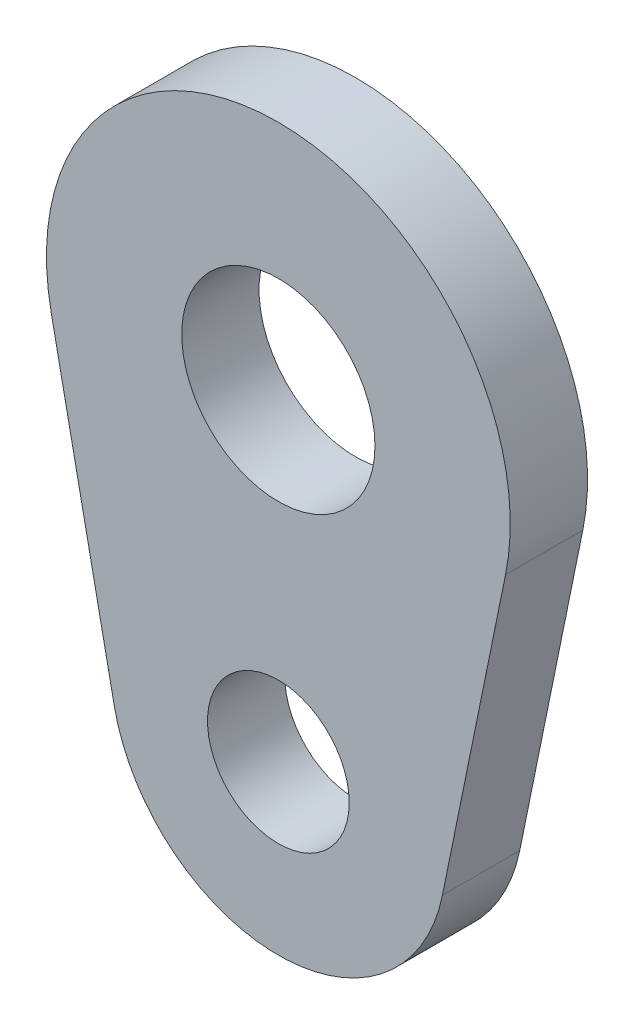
ISO-10303-21;
HEADER;
FILE_DESCRIPTION(('STEP AP214'),'2;1');
FILE_NAME('part.step','',(''),(''),'','','');
FILE_SCHEMA(('AUTOMOTIVE_DESIGN { 1 0 10303 214 1 1 1 1 }'));
ENDSEC;
DATA;
#1=APPLICATION_CONTEXT('core data for automotive mechanical design processes');
#2=APPLICATION_PROTOCOL_DEFINITION('international standard','automotive_design',2000,#1);
#3=PRODUCT_CONTEXT('',#1,'mechanical');
#4=PRODUCT('Part','Part','',(#3));
#5=PRODUCT_RELATED_PRODUCT_CATEGORY('part','',(#4));
#6=PRODUCT_DEFINITION_FORMATION('','',#4);
#7=PRODUCT_DEFINITION_CONTEXT('part definition',#1,'design');
#8=PRODUCT_DEFINITION('design','',#6,#7);
#9=PRODUCT_DEFINITION_SHAPE('','',#8);
#10=(LENGTH_UNIT() NAMED_UNIT(*) SI_UNIT(.MILLI.,.METRE.));
#11=(NAMED_UNIT(*) PLANE_ANGLE_UNIT() SI_UNIT($,.RADIAN.));
#12=(NAMED_UNIT(*) SI_UNIT($,.STERADIAN.) SOLID_ANGLE_UNIT());
#13=UNCERTAINTY_MEASURE_WITH_UNIT(LENGTH_MEASURE(1.E-05),#10,'distance_accuracy_value','');
#14=(GEOMETRIC_REPRESENTATION_CONTEXT(3) GLOBAL_UNCERTAINTY_ASSIGNED_CONTEXT((#13)) GLOBAL_UNIT_ASSIGNED_CONTEXT((#10,
#11,#12)) REPRESENTATION_CONTEXT('',''));
#15=CARTESIAN_POINT('',(0.,0.,0.));
#16=DIRECTION('',(0.,0.,1.));
#17=DIRECTION('',(1.,0.,0.));
#18=AXIS2_PLACEMENT_3D('',#15,#16,#17);
#19=CARTESIAN_POINT('',(0.,0.,6.));
#20=DIRECTION('',(0.,0.,1.));
#21=DIRECTION('',(1.,0.,0.));
#22=AXIS2_PLACEMENT_3D('',#19,#20,#21);
#23=PLANE('',#22);
#24=CARTESIAN_POINT('',(0.,0.,6.));
#25=DIRECTION('',(0.,0.,1.));
#26=DIRECTION('',(1.,0.,0.));
#27=AXIS2_PLACEMENT_3D('',#24,#25,#26);
#28=CIRCLE('',#27,7.5);
#29=CARTESIAN_POINT('',(7.5,0.,6.));
#30=VERTEX_POINT('',#29);
#31=EDGE_CURVE('E90',#30,#30,#28,.T.);
#32=ORIENTED_EDGE('',*,*,#31,.F.);
#33=EDGE_LOOP('',(#32));
#34=FACE_BOUND('',#33,.T.);
#35=CARTESIAN_POINT('',(0.,0.,6.));
#36=DIRECTION('',(0.,0.,1.));
#37=DIRECTION('',(1.,0.,0.));
#38=AXIS2_PLACEMENT_3D('',#35,#36,#37);
#39=CIRCLE('',#38,18.);
#40=CARTESIAN_POINT('',(17.6363261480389,-3.6,6.));
#41=VERTEX_POINT('',#40);
#42=CARTESIAN_POINT('',(-17.6363261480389,-3.6,6.));
#43=VERTEX_POINT('',#42);
#44=EDGE_CURVE('E100',#41,#43,#39,.T.);
#45=ORIENTED_EDGE('',*,*,#44,.T.);
#46=DIRECTION('',(0.2,-0.979795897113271,0.));
#47=VECTOR('',#46,1.);
#48=CARTESIAN_POINT('',(-17.6363261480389,-3.6,6.));
#49=LINE('',#48,#47);
#50=CARTESIAN_POINT('',(-12.7373466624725,-27.6,6.));
#51=VERTEX_POINT('',#50);
#52=EDGE_CURVE('E85',#43,#51,#49,.T.);
#53=ORIENTED_EDGE('',*,*,#52,.T.);
#54=CARTESIAN_POINT('',(0.,-25.,6.));
#55=DIRECTION('',(0.,0.,1.));
#56=DIRECTION('',(-1.,0.,0.));
#57=AXIS2_PLACEMENT_3D('',#54,#55,#56);
#58=CIRCLE('',#57,13.);
#59=CARTESIAN_POINT('',(12.7373466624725,-27.6,6.));
#60=VERTEX_POINT('',#59);
#61=EDGE_CURVE('E51',#51,#60,#58,.T.);
#62=ORIENTED_EDGE('',*,*,#61,.T.);
#63=DIRECTION('',(0.2,0.979795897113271,0.));
#64=VECTOR('',#63,1.);
#65=CARTESIAN_POINT('',(17.6363261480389,-3.6,6.));
#66=LINE('',#65,#64);
#67=EDGE_CURVE('E46',#60,#41,#66,.T.);
#68=ORIENTED_EDGE('',*,*,#67,.T.);
#69=EDGE_LOOP('',(#45,#53,#62,#68));
#70=FACE_BOUND('',#69,.T.);
#71=CARTESIAN_POINT('',(0.,-25.,6.));
#72=DIRECTION('',(0.,0.,1.));
#73=DIRECTION('',(1.,0.,0.));
#74=AXIS2_PLACEMENT_3D('',#71,#72,#73);
#75=CIRCLE('',#74,5.5);
#76=CARTESIAN_POINT('',(5.5,-25.,6.));
#77=VERTEX_POINT('',#76);
#78=EDGE_CURVE('E118',#77,#77,#75,.T.);
#79=ORIENTED_EDGE('',*,*,#78,.F.);
#80=EDGE_LOOP('',(#79));
#81=FACE_BOUND('',#80,.T.);
#82=ADVANCED_FACE('F31',(#34,#70,#81),#23,.T.);
#83=CARTESIAN_POINT('',(0.,0.,0.));
#84=DIRECTION('',(0.,0.,1.));
#85=DIRECTION('',(1.,0.,0.));
#86=AXIS2_PLACEMENT_3D('',#83,#84,#85);
#87=PLANE('',#86);
#88=CARTESIAN_POINT('',(0.,0.,0.));
#89=DIRECTION('',(0.,0.,1.));
#90=DIRECTION('',(1.,0.,0.));
#91=AXIS2_PLACEMENT_3D('',#88,#89,#90);
#92=CIRCLE('',#91,7.5);
#93=CARTESIAN_POINT('',(7.5,0.,0.));
#94=VERTEX_POINT('',#93);
#95=EDGE_CURVE('E93',#94,#94,#92,.T.);
#96=ORIENTED_EDGE('',*,*,#95,.T.);
#97=EDGE_LOOP('',(#96));
#98=FACE_BOUND('',#97,.T.);
#99=CARTESIAN_POINT('',(0.,0.,0.));
#100=DIRECTION('',(0.,0.,1.));
#101=DIRECTION('',(1.,0.,0.));
#102=AXIS2_PLACEMENT_3D('',#99,#100,#101);
#103=CIRCLE('',#102,18.);
#104=CARTESIAN_POINT('',(17.6363261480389,-3.6,0.));
#105=VERTEX_POINT('',#104);
#106=CARTESIAN_POINT('',(-17.6363261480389,-3.6,0.));
#107=VERTEX_POINT('',#106);
#108=EDGE_CURVE('E77',#105,#107,#103,.T.);
#109=ORIENTED_EDGE('',*,*,#108,.F.);
#110=DIRECTION('',(0.2,0.979795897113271,0.));
#111=VECTOR('',#110,1.);
#112=CARTESIAN_POINT('',(17.6363261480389,-3.6,0.));
#113=LINE('',#112,#111);
#114=CARTESIAN_POINT('',(12.7373466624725,-27.6,0.));
#115=VERTEX_POINT('',#114);
#116=EDGE_CURVE('E98',#115,#105,#113,.T.);
#117=ORIENTED_EDGE('',*,*,#116,.F.);
#118=CARTESIAN_POINT('',(0.,-25.,0.));
#119=DIRECTION('',(0.,0.,1.));
#120=DIRECTION('',(-1.,0.,0.));
#121=AXIS2_PLACEMENT_3D('',#118,#119,#120);
#122=CIRCLE('',#121,13.);
#123=CARTESIAN_POINT('',(-12.7373466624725,-27.6,0.));
#124=VERTEX_POINT('',#123);
#125=EDGE_CURVE('E78',#124,#115,#122,.T.);
#126=ORIENTED_EDGE('',*,*,#125,.F.);
#127=DIRECTION('',(0.2,-0.979795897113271,0.));
#128=VECTOR('',#127,1.);
#129=CARTESIAN_POINT('',(-17.6363261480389,-3.6,0.));
#130=LINE('',#129,#128);
#131=EDGE_CURVE('E72',#107,#124,#130,.T.);
#132=ORIENTED_EDGE('',*,*,#131,.F.);
#133=EDGE_LOOP('',(#109,#117,#126,#132));
#134=FACE_BOUND('',#133,.T.);
#135=CARTESIAN_POINT('',(0.,-25.,0.));
#136=DIRECTION('',(0.,0.,1.));
#137=DIRECTION('',(1.,0.,0.));
#138=AXIS2_PLACEMENT_3D('',#135,#136,#137);
#139=CIRCLE('',#138,5.5);
#140=CARTESIAN_POINT('',(5.5,-25.,0.));
#141=VERTEX_POINT('',#140);
#142=EDGE_CURVE('E120',#141,#141,#139,.T.);
#143=ORIENTED_EDGE('',*,*,#142,.T.);
#144=EDGE_LOOP('',(#143));
#145=FACE_BOUND('',#144,.T.);
#146=ADVANCED_FACE('F73',(#98,#134,#145),#87,.F.);
#147=CARTESIAN_POINT('',(0.,0.,6.));
#148=DIRECTION('',(0.,0.,-1.));
#149=DIRECTION('',(-1.,0.,0.));
#150=AXIS2_PLACEMENT_3D('',#147,#148,#149);
#151=CYLINDRICAL_SURFACE('',#150,18.);
#152=ORIENTED_EDGE('',*,*,#108,.T.);
#153=DIRECTION('',(0.,0.,-1.));
#154=VECTOR('',#153,1.);
#155=CARTESIAN_POINT('',(-17.6363261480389,-3.6,6.));
#156=LINE('',#155,#154);
#157=EDGE_CURVE('E11',#43,#107,#156,.T.);
#158=ORIENTED_EDGE('',*,*,#157,.F.);
#159=ORIENTED_EDGE('',*,*,#44,.F.);
#160=DIRECTION('',(0.,0.,-1.));
#161=VECTOR('',#160,1.);
#162=CARTESIAN_POINT('',(17.6363261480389,-3.6,6.));
#163=LINE('',#162,#161);
#164=EDGE_CURVE('E89',#41,#105,#163,.T.);
#165=ORIENTED_EDGE('',*,*,#164,.T.);
#166=EDGE_LOOP('',(#152,#158,#159,#165));
#167=FACE_BOUND('',#166,.T.);
#168=ADVANCED_FACE('F33',(#167),#151,.T.);
#169=CARTESIAN_POINT('',(-17.6363261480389,-3.6,6.));
#170=DIRECTION('',(0.979795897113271,0.2,0.));
#171=DIRECTION('',(-0.2,0.979795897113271,0.));
#172=AXIS2_PLACEMENT_3D('',#169,#170,#171);
#173=PLANE('',#172);
#174=ORIENTED_EDGE('',*,*,#131,.T.);
#175=DIRECTION('',(0.,0.,-1.));
#176=VECTOR('',#175,1.);
#177=CARTESIAN_POINT('',(-12.7373466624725,-27.6,6.));
#178=LINE('',#177,#176);
#179=EDGE_CURVE('E39',#51,#124,#178,.T.);
#180=ORIENTED_EDGE('',*,*,#179,.F.);
#181=ORIENTED_EDGE('',*,*,#52,.F.);
#182=ORIENTED_EDGE('',*,*,#157,.T.);
#183=EDGE_LOOP('',(#174,#180,#181,#182));
#184=FACE_BOUND('',#183,.T.);
#185=ADVANCED_FACE('F84',(#184),#173,.F.);
#186=CARTESIAN_POINT('',(0.,-25.,6.));
#187=DIRECTION('',(0.,0.,-1.));
#188=DIRECTION('',(-1.,0.,0.));
#189=AXIS2_PLACEMENT_3D('',#186,#187,#188);
#190=CYLINDRICAL_SURFACE('',#189,13.);
#191=ORIENTED_EDGE('',*,*,#125,.T.);
#192=DIRECTION('',(0.,0.,-1.));
#193=VECTOR('',#192,1.);
#194=CARTESIAN_POINT('',(12.7373466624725,-27.6,6.));
#195=LINE('',#194,#193);
#196=EDGE_CURVE('E106',#60,#115,#195,.T.);
#197=ORIENTED_EDGE('',*,*,#196,.F.);
#198=ORIENTED_EDGE('',*,*,#61,.F.);
#199=ORIENTED_EDGE('',*,*,#179,.T.);
#200=EDGE_LOOP('',(#191,#197,#198,#199));
#201=FACE_BOUND('',#200,.T.);
#202=ADVANCED_FACE('F109',(#201),#190,.T.);
#203=CARTESIAN_POINT('',(17.6363261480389,-3.6,6.));
#204=DIRECTION('',(-0.979795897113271,0.2,0.));
#205=DIRECTION('',(-0.2,-0.979795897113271,0.));
#206=AXIS2_PLACEMENT_3D('',#203,#204,#205);
#207=PLANE('',#206);
#208=ORIENTED_EDGE('',*,*,#116,.T.);
#209=ORIENTED_EDGE('',*,*,#164,.F.);
#210=ORIENTED_EDGE('',*,*,#67,.F.);
#211=ORIENTED_EDGE('',*,*,#196,.T.);
#212=EDGE_LOOP('',(#208,#209,#210,#211));
#213=FACE_BOUND('',#212,.T.);
#214=ADVANCED_FACE('F111',(#213),#207,.F.);
#215=CARTESIAN_POINT('',(0.,0.,6.));
#216=DIRECTION('',(0.,0.,-1.));
#217=DIRECTION('',(-1.,0.,0.));
#218=AXIS2_PLACEMENT_3D('',#215,#216,#217);
#219=CYLINDRICAL_SURFACE('',#218,7.5);
#220=ORIENTED_EDGE('',*,*,#31,.T.);
#221=EDGE_LOOP('',(#220));
#222=FACE_BOUND('',#221,.T.);
#223=ORIENTED_EDGE('',*,*,#95,.F.);
#224=EDGE_LOOP('',(#223));
#225=FACE_BOUND('',#224,.T.);
#226=ADVANCED_FACE('F129',(#222,#225),#219,.F.);
#227=CARTESIAN_POINT('',(0.,-25.,6.));
#228=DIRECTION('',(0.,0.,-1.));
#229=DIRECTION('',(-1.,0.,0.));
#230=AXIS2_PLACEMENT_3D('',#227,#228,#229);
#231=CYLINDRICAL_SURFACE('',#230,5.5);
#232=ORIENTED_EDGE('',*,*,#78,.T.);
#233=EDGE_LOOP('',(#232));
#234=FACE_BOUND('',#233,.T.);
#235=ORIENTED_EDGE('',*,*,#142,.F.);
#236=EDGE_LOOP('',(#235));
#237=FACE_BOUND('',#236,.T.);
#238=ADVANCED_FACE('F127',(#234,#237),#231,.F.);
#239=CLOSED_SHELL('',(#82,#146,#168,#185,#202,#214,#226,#238));
#240=MANIFOLD_SOLID_BREP('B2',#239);
#241=ADVANCED_BREP_SHAPE_REPRESENTATION('',(#18,#240),#14);
#242=SHAPE_DEFINITION_REPRESENTATION(#9,#241);
ENDSEC;
END-ISO-10303-21;
